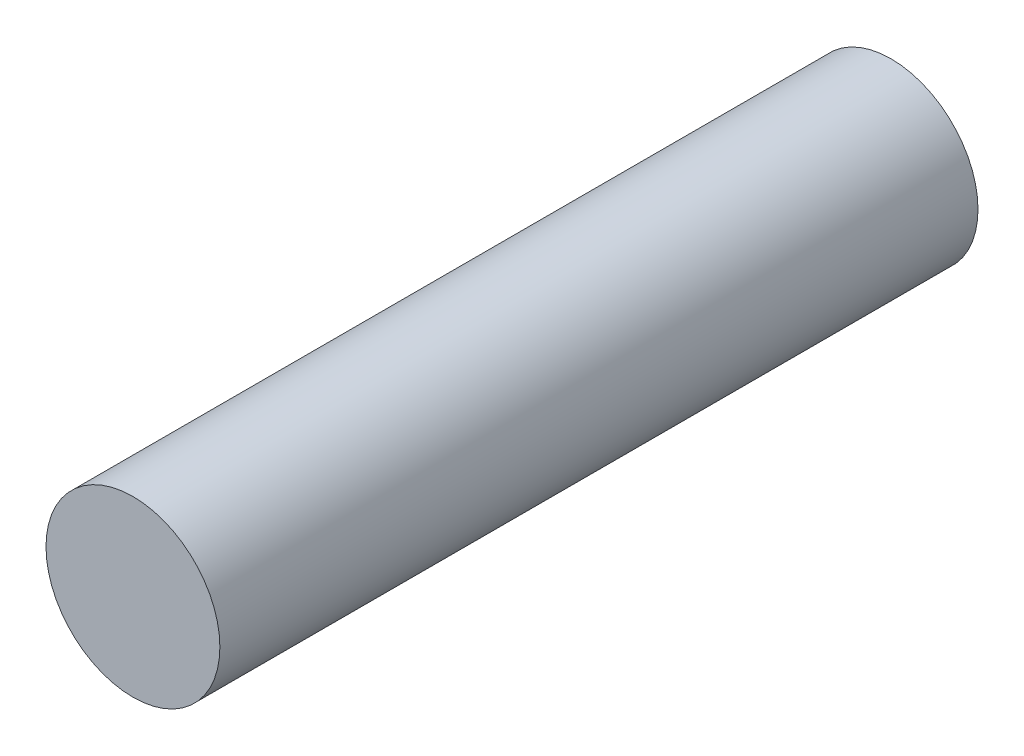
ISO-10303-21;
HEADER;
FILE_DESCRIPTION(('STEP AP214'),'2;1');
FILE_NAME('part.step','',(''),(''),'','','');
FILE_SCHEMA(('AUTOMOTIVE_DESIGN { 1 0 10303 214 1 1 1 1 }'));
ENDSEC;
DATA;
#1=APPLICATION_CONTEXT('core data for automotive mechanical design processes');
#2=APPLICATION_PROTOCOL_DEFINITION('international standard','automotive_design',2000,#1);
#3=PRODUCT_CONTEXT('',#1,'mechanical');
#4=PRODUCT('Part','Part','',(#3));
#5=PRODUCT_RELATED_PRODUCT_CATEGORY('part','',(#4));
#6=PRODUCT_DEFINITION_FORMATION('','',#4);
#7=PRODUCT_DEFINITION_CONTEXT('part definition',#1,'design');
#8=PRODUCT_DEFINITION('design','',#6,#7);
#9=PRODUCT_DEFINITION_SHAPE('','',#8);
#10=(LENGTH_UNIT() NAMED_UNIT(*) SI_UNIT(.MILLI.,.METRE.));
#11=(NAMED_UNIT(*) PLANE_ANGLE_UNIT() SI_UNIT($,.RADIAN.));
#12=(NAMED_UNIT(*) SI_UNIT($,.STERADIAN.) SOLID_ANGLE_UNIT());
#13=UNCERTAINTY_MEASURE_WITH_UNIT(LENGTH_MEASURE(1.E-05),#10,'distance_accuracy_value','');
#14=(GEOMETRIC_REPRESENTATION_CONTEXT(3) GLOBAL_UNCERTAINTY_ASSIGNED_CONTEXT((#13)) GLOBAL_UNIT_ASSIGNED_CONTEXT((#10,
#11,#12)) REPRESENTATION_CONTEXT('',''));
#15=CARTESIAN_POINT('',(0.,0.,0.));
#16=DIRECTION('',(0.,0.,1.));
#17=DIRECTION('',(1.,0.,0.));
#18=AXIS2_PLACEMENT_3D('',#15,#16,#17);
#19=CARTESIAN_POINT('',(0.,0.,27.686));
#20=DIRECTION('',(0.,0.,-1.));
#21=DIRECTION('',(-1.,0.,0.));
#22=AXIS2_PLACEMENT_3D('',#19,#20,#21);
#23=CYLINDRICAL_SURFACE('',#22,3.175);
#24=CARTESIAN_POINT('',(0.,0.,27.686));
#25=DIRECTION('',(0.,0.,1.));
#26=DIRECTION('',(1.,0.,0.));
#27=AXIS2_PLACEMENT_3D('',#24,#25,#26);
#28=CIRCLE('',#27,3.175);
#29=CARTESIAN_POINT('',(3.175,0.,27.686));
#30=VERTEX_POINT('',#29);
#31=EDGE_CURVE('E10',#30,#30,#28,.T.);
#32=ORIENTED_EDGE('',*,*,#31,.F.);
#33=EDGE_LOOP('',(#32));
#34=FACE_BOUND('',#33,.T.);
#35=CARTESIAN_POINT('',(0.,0.,0.));
#36=DIRECTION('',(0.,0.,1.));
#37=DIRECTION('',(1.,0.,0.));
#38=AXIS2_PLACEMENT_3D('',#35,#36,#37);
#39=CIRCLE('',#38,3.175);
#40=CARTESIAN_POINT('',(3.175,0.,0.));
#41=VERTEX_POINT('',#40);
#42=EDGE_CURVE('E33',#41,#41,#39,.T.);
#43=ORIENTED_EDGE('',*,*,#42,.T.);
#44=EDGE_LOOP('',(#43));
#45=FACE_BOUND('',#44,.T.);
#46=ADVANCED_FACE('F30',(#34,#45),#23,.T.);
#47=CARTESIAN_POINT('',(0.,0.,27.686));
#48=DIRECTION('',(0.,0.,1.));
#49=DIRECTION('',(1.,0.,0.));
#50=AXIS2_PLACEMENT_3D('',#47,#48,#49);
#51=PLANE('',#50);
#52=ORIENTED_EDGE('',*,*,#31,.T.);
#53=EDGE_LOOP('',(#52));
#54=FACE_BOUND('',#53,.T.);
#55=ADVANCED_FACE('F45',(#54),#51,.T.);
#56=CARTESIAN_POINT('',(0.,0.,0.));
#57=DIRECTION('',(0.,0.,1.));
#58=DIRECTION('',(1.,0.,0.));
#59=AXIS2_PLACEMENT_3D('',#56,#57,#58);
#60=PLANE('',#59);
#61=ORIENTED_EDGE('',*,*,#42,.F.);
#62=EDGE_LOOP('',(#61));
#63=FACE_BOUND('',#62,.T.);
#64=ADVANCED_FACE('F43',(#63),#60,.F.);
#65=CLOSED_SHELL('',(#46,#55,#64));
#66=MANIFOLD_SOLID_BREP('B2',#65);
#67=ADVANCED_BREP_SHAPE_REPRESENTATION('',(#18,#66),#14);
#68=SHAPE_DEFINITION_REPRESENTATION(#9,#67);
ENDSEC;
END-ISO-10303-21;
